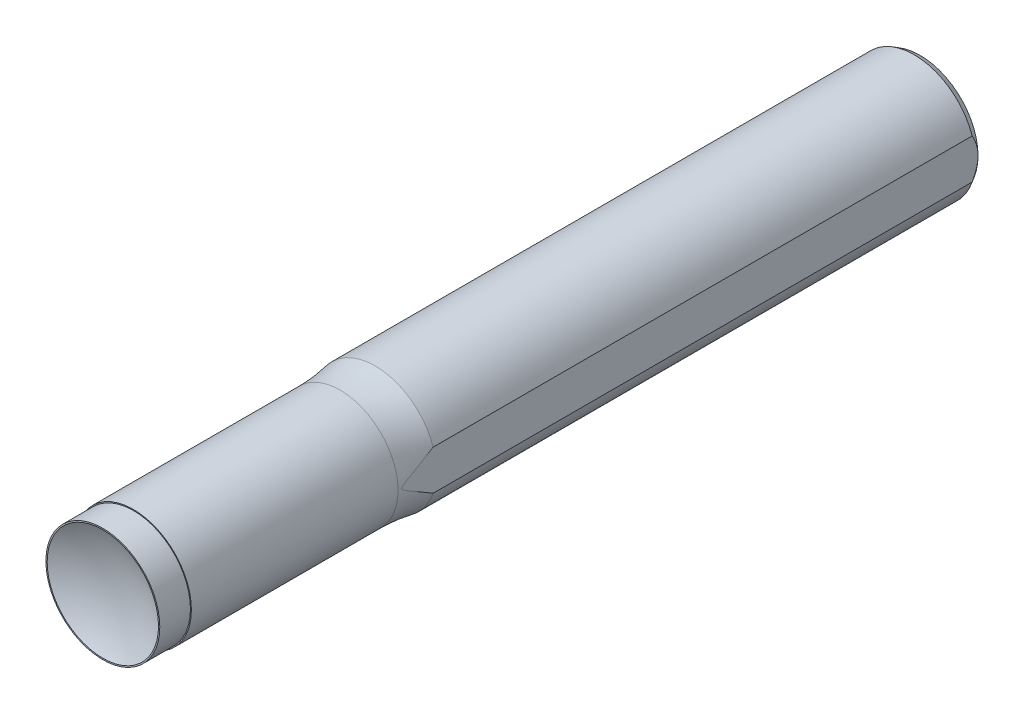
ISO-10303-21;
HEADER;
FILE_DESCRIPTION(('STEP AP214'),'2;1');
FILE_NAME('part.step','',(''),(''),'','','');
FILE_SCHEMA(('AUTOMOTIVE_DESIGN { 1 0 10303 214 1 1 1 1 }'));
ENDSEC;
DATA;
#1=APPLICATION_CONTEXT('core data for automotive mechanical design processes');
#2=APPLICATION_PROTOCOL_DEFINITION('international standard','automotive_design',2000,#1);
#3=PRODUCT_CONTEXT('',#1,'mechanical');
#4=PRODUCT('Part','Part','',(#3));
#5=PRODUCT_RELATED_PRODUCT_CATEGORY('part','',(#4));
#6=PRODUCT_DEFINITION_FORMATION('','',#4);
#7=PRODUCT_DEFINITION_CONTEXT('part definition',#1,'design');
#8=PRODUCT_DEFINITION('design','',#6,#7);
#9=PRODUCT_DEFINITION_SHAPE('','',#8);
#10=(LENGTH_UNIT() NAMED_UNIT(*) SI_UNIT(.MILLI.,.METRE.));
#11=(NAMED_UNIT(*) PLANE_ANGLE_UNIT() SI_UNIT($,.RADIAN.));
#12=(NAMED_UNIT(*) SI_UNIT($,.STERADIAN.) SOLID_ANGLE_UNIT());
#13=UNCERTAINTY_MEASURE_WITH_UNIT(LENGTH_MEASURE(1.E-05),#10,'distance_accuracy_value','');
#14=(GEOMETRIC_REPRESENTATION_CONTEXT(3) GLOBAL_UNCERTAINTY_ASSIGNED_CONTEXT((#13)) GLOBAL_UNIT_ASSIGNED_CONTEXT((#10,
#11,#12)) REPRESENTATION_CONTEXT('',''));
#15=CARTESIAN_POINT('',(0.,0.,0.));
#16=DIRECTION('',(0.,0.,1.));
#17=DIRECTION('',(1.,0.,0.));
#18=AXIS2_PLACEMENT_3D('',#15,#16,#17);
#19=CARTESIAN_POINT('',(0.,0.,-42.3333333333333));
#20=DIRECTION('',(0.,0.,1.));
#21=DIRECTION('',(1.,0.,0.));
#22=AXIS2_PLACEMENT_3D('',#19,#20,#21);
#23=CYLINDRICAL_SURFACE('',#22,9.);
#24=CARTESIAN_POINT('',(0.,0.,-36.8809829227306));
#25=DIRECTION('',(0.,0.,1.));
#26=DIRECTION('',(0.,-1.,0.));
#27=AXIS2_PLACEMENT_3D('',#24,#25,#26);
#28=CIRCLE('',#27,9.);
#29=CARTESIAN_POINT('',(0.,-9.,-36.8809829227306));
#30=VERTEX_POINT('',#29);
#31=EDGE_CURVE('E79',#30,#30,#28,.F.);
#32=ORIENTED_EDGE('',*,*,#31,.F.);
#33=EDGE_LOOP('',(#32));
#34=FACE_BOUND('',#33,.T.);
#35=CARTESIAN_POINT('',(0.,0.,-4.7625));
#36=DIRECTION('',(0.,0.,1.));
#37=DIRECTION('',(1.,0.,0.));
#38=AXIS2_PLACEMENT_3D('',#35,#36,#37);
#39=CIRCLE('',#38,9.);
#40=CARTESIAN_POINT('',(9.,0.,-4.7625));
#41=VERTEX_POINT('',#40);
#42=EDGE_CURVE('E90',#41,#41,#39,.F.);
#43=ORIENTED_EDGE('',*,*,#42,.T.);
#44=EDGE_LOOP('',(#43));
#45=FACE_BOUND('',#44,.T.);
#46=ADVANCED_FACE('F42',(#34,#45),#23,.T.);
#47=CARTESIAN_POINT('',(0.,0.,-4.7625));
#48=DIRECTION('',(0.,0.,1.));
#49=DIRECTION('',(1.,0.,0.));
#50=AXIS2_PLACEMENT_3D('',#47,#48,#49);
#51=PLANE('',#50);
#52=ORIENTED_EDGE('',*,*,#42,.F.);
#53=EDGE_LOOP('',(#52));
#54=FACE_BOUND('',#53,.T.);
#55=CARTESIAN_POINT('',(0.,0.,-4.7625));
#56=DIRECTION('',(0.,0.,1.));
#57=DIRECTION('',(1.,0.,0.));
#58=AXIS2_PLACEMENT_3D('',#55,#56,#57);
#59=CIRCLE('',#58,8.85);
#60=CARTESIAN_POINT('',(8.85,0.,-4.7625));
#61=VERTEX_POINT('',#60);
#62=EDGE_CURVE('E97',#61,#61,#59,.T.);
#63=ORIENTED_EDGE('',*,*,#62,.F.);
#64=EDGE_LOOP('',(#63));
#65=FACE_BOUND('',#64,.T.);
#66=ADVANCED_FACE('F110',(#54,#65),#51,.T.);
#67=CARTESIAN_POINT('',(0.,0.,-4.7625));
#68=DIRECTION('',(0.,0.,1.));
#69=DIRECTION('',(1.,0.,0.));
#70=AXIS2_PLACEMENT_3D('',#67,#68,#69);
#71=CYLINDRICAL_SURFACE('',#70,8.85);
#72=CARTESIAN_POINT('',(0.,0.,0.));
#73=DIRECTION('',(0.,0.,1.));
#74=DIRECTION('',(1.,0.,0.));
#75=AXIS2_PLACEMENT_3D('',#72,#73,#74);
#76=CIRCLE('',#75,8.85);
#77=CARTESIAN_POINT('',(8.85,0.,0.));
#78=VERTEX_POINT('',#77);
#79=EDGE_CURVE('E121',#78,#78,#76,.T.);
#80=CARTESIAN_POINT('',(8.85,0.,-4.7625));
#81=CARTESIAN_POINT('',(8.85,0.,-4.712890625));
#82=CARTESIAN_POINT('',(8.85,0.,-4.66328125));
#83=CARTESIAN_POINT('',(8.85,0.,-4.5640625));
#84=CARTESIAN_POINT('',(8.85,0.,-4.514453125));
#85=CARTESIAN_POINT('',(8.85,0.,-4.415234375));
#86=CARTESIAN_POINT('',(8.85,0.,-4.365625));
#87=CARTESIAN_POINT('',(8.85,0.,-4.26640625));
#88=CARTESIAN_POINT('',(8.85,0.,-4.216796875));
#89=CARTESIAN_POINT('',(8.85,0.,-4.117578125));
#90=CARTESIAN_POINT('',(8.85,0.,-4.06796875));
#91=CARTESIAN_POINT('',(8.85,0.,-3.96875));
#92=CARTESIAN_POINT('',(8.85,0.,-3.919140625));
#93=CARTESIAN_POINT('',(8.85,0.,-3.819921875));
#94=CARTESIAN_POINT('',(8.85,0.,-3.7703125));
#95=CARTESIAN_POINT('',(8.85,0.,-3.67109375));
#96=CARTESIAN_POINT('',(8.85,0.,-3.621484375));
#97=CARTESIAN_POINT('',(8.85,0.,-3.522265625));
#98=CARTESIAN_POINT('',(8.85,0.,-3.47265625));
#99=CARTESIAN_POINT('',(8.85,0.,-3.3734375));
#100=CARTESIAN_POINT('',(8.85,0.,-3.323828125));
#101=CARTESIAN_POINT('',(8.85,0.,-3.224609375));
#102=CARTESIAN_POINT('',(8.85,0.,-3.175));
#103=CARTESIAN_POINT('',(8.85,0.,-3.07578125));
#104=CARTESIAN_POINT('',(8.85,0.,-3.026171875));
#105=CARTESIAN_POINT('',(8.85,0.,-2.926953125));
#106=CARTESIAN_POINT('',(8.85,0.,-2.87734375));
#107=CARTESIAN_POINT('',(8.85,0.,-2.778125));
#108=CARTESIAN_POINT('',(8.85,0.,-2.728515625));
#109=CARTESIAN_POINT('',(8.85,0.,-2.629296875));
#110=CARTESIAN_POINT('',(8.85,0.,-2.5796875));
#111=CARTESIAN_POINT('',(8.85,0.,-2.48046875));
#112=CARTESIAN_POINT('',(8.85,0.,-2.430859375));
#113=CARTESIAN_POINT('',(8.85,0.,-2.331640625));
#114=CARTESIAN_POINT('',(8.85,0.,-2.28203125));
#115=CARTESIAN_POINT('',(8.85,0.,-2.1828125));
#116=CARTESIAN_POINT('',(8.85,0.,-2.133203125));
#117=CARTESIAN_POINT('',(8.85,0.,-2.033984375));
#118=CARTESIAN_POINT('',(8.85,0.,-1.984375));
#119=CARTESIAN_POINT('',(8.85,0.,-1.88515625));
#120=CARTESIAN_POINT('',(8.85,0.,-1.835546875));
#121=CARTESIAN_POINT('',(8.85,0.,-1.736328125));
#122=CARTESIAN_POINT('',(8.85,0.,-1.68671875));
#123=CARTESIAN_POINT('',(8.85,0.,-1.5875));
#124=CARTESIAN_POINT('',(8.85,0.,-1.537890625));
#125=CARTESIAN_POINT('',(8.85,0.,-1.438671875));
#126=CARTESIAN_POINT('',(8.85,0.,-1.3890625));
#127=CARTESIAN_POINT('',(8.85,0.,-1.28984375));
#128=CARTESIAN_POINT('',(8.85,0.,-1.240234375));
#129=CARTESIAN_POINT('',(8.85,0.,-1.141015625));
#130=CARTESIAN_POINT('',(8.85,0.,-1.09140625));
#131=CARTESIAN_POINT('',(8.85,0.,-0.9921875));
#132=CARTESIAN_POINT('',(8.85,0.,-0.942578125));
#133=CARTESIAN_POINT('',(8.85,0.,-0.843359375));
#134=CARTESIAN_POINT('',(8.85,0.,-0.79375));
#135=CARTESIAN_POINT('',(8.85,0.,-0.69453125));
#136=CARTESIAN_POINT('',(8.85,0.,-0.644921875));
#137=CARTESIAN_POINT('',(8.85,0.,-0.545703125));
#138=CARTESIAN_POINT('',(8.85,0.,-0.49609375));
#139=CARTESIAN_POINT('',(8.85,0.,-0.396875));
#140=CARTESIAN_POINT('',(8.85,0.,-0.347265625));
#141=CARTESIAN_POINT('',(8.85,0.,-0.248046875));
#142=CARTESIAN_POINT('',(8.85,0.,-0.1984375));
#143=CARTESIAN_POINT('',(8.85,0.,-0.09921875));
#144=CARTESIAN_POINT('',(8.85,0.,-0.049609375));
#145=CARTESIAN_POINT('',(8.85,0.,0.));
#146=B_SPLINE_CURVE_WITH_KNOTS('',3,(#80,#81,#82,#83,#84,#85,#86,#87,#88,#89,#90,#91,#92,#93,
#94,#95,#96,#97,#98,#99,#100,#101,#102,#103,#104,#105,#106,#107,#108,#109,#110,#111,#112,#113,
#114,#115,#116,#117,#118,#119,#120,#121,#122,#123,#124,#125,#126,#127,#128,#129,#130,#131,#132,
#133,#134,#135,#136,#137,#138,#139,#140,#141,#142,#143,#144,#145),.UNSPECIFIED.,.F.,.F.,(4,2,2,
2,2,2,2,2,2,2,2,2,2,2,2,2,2,2,2,2,2,2,2,2,2,2,2,2,2,2,2,2,4),(0.,0.148828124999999,
0.297656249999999,0.446484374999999,0.595312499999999,0.744140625,0.89296875,1.041796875,
1.190625,1.339453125,1.48828125,1.637109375,1.7859375,1.934765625,2.08359375,2.232421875,
2.38125,2.530078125,2.67890625,2.827734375,2.9765625,3.125390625,3.27421875,3.423046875,
3.571875,3.720703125,3.86953125,4.018359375,4.1671875,4.316015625,4.46484375,4.613671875,
4.7625),.UNSPECIFIED.);
#147=EDGE_CURVE('BSEAM116',#61,#78,#146,.T.);
#148=ORIENTED_EDGE('',*,*,#62,.T.);
#149=ORIENTED_EDGE('',*,*,#79,.F.);
#150=ORIENTED_EDGE('',*,*,#147,.T.);
#151=ORIENTED_EDGE('',*,*,#147,.F.);
#152=EDGE_LOOP('',(#148,#150,#149,#151));
#153=FACE_BOUND('',#152,.T.);
#154=ADVANCED_FACE('F116',(#153),#71,.T.);
#155=CARTESIAN_POINT('',(0.,0.,0.));
#156=DIRECTION('',(0.,0.,1.));
#157=DIRECTION('',(1.,0.,0.));
#158=AXIS2_PLACEMENT_3D('',#155,#156,#157);
#159=PLANE('',#158);
#160=CARTESIAN_POINT('',(0.,0.,0.));
#161=DIRECTION('',(0.,0.,1.));
#162=DIRECTION('',(0.,-1.,0.));
#163=AXIS2_PLACEMENT_3D('',#160,#161,#162);
#164=CIRCLE('',#163,8.65);
#165=CARTESIAN_POINT('',(0.,-8.65,0.));
#166=VERTEX_POINT('',#165);
#167=EDGE_CURVE('E125',#166,#166,#164,.T.);
#168=ORIENTED_EDGE('',*,*,#167,.F.);
#169=EDGE_LOOP('',(#168));
#170=FACE_BOUND('',#169,.T.);
#171=ORIENTED_EDGE('',*,*,#79,.T.);
#172=EDGE_LOOP('',(#171));
#173=FACE_BOUND('',#172,.T.);
#174=ADVANCED_FACE('F156',(#170,#173),#159,.T.);
#175=CARTESIAN_POINT('',(0.,0.,16.9729196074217));
#176=DIRECTION('',(0.,0.,1.));
#177=DIRECTION('',(0.,1.,0.));
#178=AXIS2_PLACEMENT_3D('',#175,#176,#177);
#179=SPHERICAL_SURFACE('',#178,19.05);
#180=ORIENTED_EDGE('',*,*,#167,.T.);
#181=EDGE_LOOP('',(#180));
#182=FACE_BOUND('',#181,.T.);
#183=ADVANCED_FACE('F159',(#182),#179,.F.);
#184=CARTESIAN_POINT('',(0.,0.,-36.8809829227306));
#185=DIRECTION('',(0.,0.,-1.));
#186=DIRECTION('',(0.,1.,0.));
#187=AXIS2_PLACEMENT_3D('',#184,#185,#186);
#188=TOROIDAL_SURFACE('',#187,37.575,28.575);
#189=CARTESIAN_POINT('',(9.00538475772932,8.67725819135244,-50.5944537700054));
#190=CARTESIAN_POINT('',(9.00538475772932,8.360516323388,-50.1927058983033));
#191=CARTESIAN_POINT('',(9.00538475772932,8.04942168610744,-49.786548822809));
#192=CARTESIAN_POINT('',(9.00538475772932,7.43781032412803,-48.9664415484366));
#193=CARTESIAN_POINT('',(9.00538475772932,7.1372919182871,-48.5524926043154));
#194=CARTESIAN_POINT('',(9.00538475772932,6.54634415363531,-47.7181615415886));
#195=CARTESIAN_POINT('',(9.00538475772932,6.25590396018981,-47.297787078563));
#196=CARTESIAN_POINT('',(9.00538475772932,5.68384783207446,-46.4510599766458));
#197=CARTESIAN_POINT('',(9.00538475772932,5.40223227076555,-46.0247070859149));
#198=CARTESIAN_POINT('',(9.00538475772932,4.84746770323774,-45.167919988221));
#199=CARTESIAN_POINT('',(9.00538475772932,4.57430082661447,-44.7374973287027));
#200=CARTESIAN_POINT('',(9.00538475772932,4.03465670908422,-43.87249524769));
#201=CARTESIAN_POINT('',(9.00538475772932,3.76817938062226,-43.4379158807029));
#202=CARTESIAN_POINT('',(9.00538475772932,3.24058462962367,-42.5654000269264));
#203=CARTESIAN_POINT('',(9.00538475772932,2.97946833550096,-42.1274628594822));
#204=CARTESIAN_POINT('',(9.00538475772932,2.4611922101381,-41.2492576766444));
#205=CARTESIAN_POINT('',(9.00538475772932,2.20403239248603,-40.8089896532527));
#206=CARTESIAN_POINT('',(9.00538475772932,1.78617791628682,-40.0907109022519));
#207=CARTESIAN_POINT('',(9.00538475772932,1.62501467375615,-39.8129696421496));
#208=CARTESIAN_POINT('',(9.00538475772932,1.30228318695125,-39.2577811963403));
#209=CARTESIAN_POINT('',(9.00538475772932,1.14071502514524,-38.980333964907));
#210=CARTESIAN_POINT('',(9.00538475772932,0.908170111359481,-38.5881784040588));
#211=CARTESIAN_POINT('',(9.00538475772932,0.838993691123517,-38.4724013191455));
#212=CARTESIAN_POINT('',(9.00538475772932,0.698861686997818,-38.2418326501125));
#213=CARTESIAN_POINT('',(9.00538475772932,0.627905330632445,-38.1270415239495));
#214=CARTESIAN_POINT('',(9.00538475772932,0.499784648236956,-37.9283676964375));
#215=CARTESIAN_POINT('',(9.00538475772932,0.443562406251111,-37.8438778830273));
#216=CARTESIAN_POINT('',(9.00538475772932,0.345175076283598,-37.7077323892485));
#217=CARTESIAN_POINT('',(9.00538475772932,0.304872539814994,-37.6548263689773));
#218=CARTESIAN_POINT('',(9.00538475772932,0.239031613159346,-37.5795982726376));
#219=CARTESIAN_POINT('',(9.00538475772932,0.216027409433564,-37.5550721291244));
#220=CARTESIAN_POINT('',(9.00538475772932,0.166959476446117,-37.5092418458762));
#221=CARTESIAN_POINT('',(9.00538475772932,0.140918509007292,-37.4879161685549));
#222=CARTESIAN_POINT('',(9.00538475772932,0.101310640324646,-37.4640316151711));
#223=CARTESIAN_POINT('',(9.00538475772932,0.0899162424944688,-37.4579950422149));
#224=CARTESIAN_POINT('',(9.00538475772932,0.0663316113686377,-37.4477755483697));
#225=CARTESIAN_POINT('',(9.00538475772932,0.0541440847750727,-37.4435866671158));
#226=CARTESIAN_POINT('',(9.00538475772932,0.0317764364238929,-37.4383069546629));
#227=CARTESIAN_POINT('',(9.00538475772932,0.0217083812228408,-37.4367519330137));
#228=CARTESIAN_POINT('',(9.00538475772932,0.00145076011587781,-37.435412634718));
#229=CARTESIAN_POINT('',(9.00538475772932,-0.00873878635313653,-37.435628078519));
#230=CARTESIAN_POINT('',(9.00538475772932,-0.0288947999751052,-37.4377930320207));
#231=CARTESIAN_POINT('',(9.00538475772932,-0.0388618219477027,-37.439737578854));
#232=CARTESIAN_POINT('',(9.00538475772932,-0.0583851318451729,-37.4451003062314));
#233=CARTESIAN_POINT('',(9.00538475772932,-0.0679410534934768,-37.448519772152));
#234=CARTESIAN_POINT('',(9.00538475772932,-0.0935600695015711,-37.4594972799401));
#235=CARTESIAN_POINT('',(9.00538475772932,-0.109109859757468,-37.4682334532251));
#236=CARTESIAN_POINT('',(9.00538475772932,-0.138829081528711,-37.487823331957));
#237=CARTESIAN_POINT('',(9.00538475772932,-0.152991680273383,-37.4986867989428));
#238=CARTESIAN_POINT('',(9.00538475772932,-0.215025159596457,-37.5505926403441));
#239=CARTESIAN_POINT('',(9.00538475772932,-0.257135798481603,-37.5981975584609));
#240=CARTESIAN_POINT('',(9.00538475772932,-0.336996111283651,-37.6968422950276));
#241=CARTESIAN_POINT('',(9.00538475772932,-0.374711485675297,-37.747904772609));
#242=CARTESIAN_POINT('',(9.00538475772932,-0.483449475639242,-37.9018139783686));
#243=CARTESIAN_POINT('',(9.00538475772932,-0.551372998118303,-38.0069407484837));
#244=CARTESIAN_POINT('',(9.00538475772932,-0.684657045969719,-38.2188045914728));
#245=CARTESIAN_POINT('',(9.00538475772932,-0.750014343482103,-38.3255434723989));
#246=CARTESIAN_POINT('',(9.00538475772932,-0.879095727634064,-38.5393412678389));
#247=CARTESIAN_POINT('',(9.00538475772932,-0.942826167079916,-38.6463961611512));
#248=CARTESIAN_POINT('',(9.00538475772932,-1.06961925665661,-38.8608148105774));
#249=CARTESIAN_POINT('',(9.00538475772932,-1.13268222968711,-38.9681783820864));
#250=CARTESIAN_POINT('',(9.00538475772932,-1.32132247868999,-39.2904392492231));
#251=CARTESIAN_POINT('',(9.00538475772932,-1.44641873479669,-39.505620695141));
#252=CARTESIAN_POINT('',(9.00538475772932,-1.69647961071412,-39.9360597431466));
#253=CARTESIAN_POINT('',(9.00538475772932,-1.82144422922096,-40.1513173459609));
#254=CARTESIAN_POINT('',(9.00538475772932,-2.1969483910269,-40.7968422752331));
#255=CARTESIAN_POINT('',(9.00538475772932,-2.44805295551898,-41.2267832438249));
#256=CARTESIAN_POINT('',(9.00538475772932,-2.9543689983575,-42.0851322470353));
#257=CARTESIAN_POINT('',(9.00538475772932,-3.20958616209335,-42.5135369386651));
#258=CARTESIAN_POINT('',(9.00538475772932,-3.72513842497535,-43.3672539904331));
#259=CARTESIAN_POINT('',(9.00538475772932,-3.98547346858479,-43.7925663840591));
#260=CARTESIAN_POINT('',(9.00538475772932,-4.59115410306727,-44.7656913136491));
#261=CARTESIAN_POINT('',(9.00538475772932,-4.93867072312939,-45.3121585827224));
#262=CARTESIAN_POINT('',(9.00538475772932,-5.64660812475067,-46.3966394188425));
#263=CARTESIAN_POINT('',(9.00538475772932,-6.00702804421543,-46.9346535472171));
#264=CARTESIAN_POINT('',(9.00538475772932,-6.74258485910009,-48.0001402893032));
#265=CARTESIAN_POINT('',(9.00538475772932,-7.11771373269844,-48.527618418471));
#266=CARTESIAN_POINT('',(9.00538475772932,-7.88461680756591,-49.570568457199));
#267=CARTESIAN_POINT('',(9.00538475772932,-8.27639614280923,-50.0860365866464));
#268=CARTESIAN_POINT('',(9.00538475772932,-8.67725819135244,-50.5944537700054));
#269=B_SPLINE_CURVE_WITH_KNOTS('',3,(#189,#190,#191,#192,#193,#194,#195,#196,#197,#198,#199,
#200,#201,#202,#203,#204,#205,#206,#207,#208,#209,#210,#211,#212,#213,#214,#215,#216,#217,#218,
#219,#220,#221,#222,#223,#224,#225,#226,#227,#228,#229,#230,#231,#232,#233,#234,#235,#236,#237,
#238,#239,#240,#241,#242,#243,#244,#245,#246,#247,#248,#249,#250,#251,#252,#253,#254,#255,#256,
#257,#258,#259,#260,#261,#262,#263,#264,#265,#266,#267,#268),.UNSPECIFIED.,.F.,.F.,(4,2,2,2,2,2,
2,2,2,2,2,2,2,2,2,2,2,2,2,2,2,2,2,2,2,2,2,2,2,2,2,2,2,2,2,2,2,2,2,4),(0.,1.53467788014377,
3.06911070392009,4.60183932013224,6.13463269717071,7.66392477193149,9.19319682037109,
10.7227875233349,12.2523834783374,13.2157300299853,14.1788941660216,14.5835044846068,
14.9882935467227,15.2927250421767,15.4918768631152,15.5927080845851,15.6928269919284,
15.7313998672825,15.7698473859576,15.800268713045,15.830685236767,15.8610147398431,
15.8913707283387,15.9445651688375,15.9980096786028,16.1872142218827,16.3778083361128,
16.75289895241,17.1284471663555,17.5021855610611,17.8757340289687,18.622433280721,
19.3691398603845,20.8628248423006,22.3587905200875,23.8547399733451,25.7974040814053,
27.739938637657,29.681428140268,31.6235206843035),.UNSPECIFIED.);
#270=CARTESIAN_POINT('',(9.00538475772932,3.10300988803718,-42.3333333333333));
#271=VERTEX_POINT('',#270);
#272=CARTESIAN_POINT('',(9.00538475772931,-3.10300988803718,-42.3333333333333));
#273=VERTEX_POINT('',#272);
#274=EDGE_CURVE('E58',#271,#273,#269,.T.);
#275=ORIENTED_EDGE('',*,*,#274,.F.);
#276=CARTESIAN_POINT('',(0.,0.,-42.3333333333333));
#277=DIRECTION('',(0.,0.,-1.));
#278=DIRECTION('',(0.,1.,0.));
#279=AXIS2_PLACEMENT_3D('',#276,#277,#278);
#280=CIRCLE('',#279,9.525);
#281=EDGE_CURVE('E129',#273,#271,#280,.T.);
#282=ORIENTED_EDGE('',*,*,#281,.F.);
#283=EDGE_LOOP('',(#275,#282));
#284=FACE_BOUND('',#283,.T.);
#285=ORIENTED_EDGE('',*,*,#31,.T.);
#286=EDGE_LOOP('',(#285));
#287=FACE_BOUND('',#286,.T.);
#288=ADVANCED_FACE('F106',(#284,#287),#188,.F.);
#289=CARTESIAN_POINT('',(0.,0.,-127.));
#290=DIRECTION('',(0.,0.,1.));
#291=DIRECTION('',(1.,0.,0.));
#292=AXIS2_PLACEMENT_3D('',#289,#290,#291);
#293=PLANE('',#292);
#294=CARTESIAN_POINT('',(0.,0.,-127.));
#295=DIRECTION('',(0.,0.,1.));
#296=DIRECTION('',(1.,0.,0.));
#297=AXIS2_PLACEMENT_3D('',#294,#295,#296);
#298=CIRCLE('',#297,9.00538475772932);
#299=CARTESIAN_POINT('',(9.00538475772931,0.,-127.));
#300=VERTEX_POINT('',#299);
#301=EDGE_CURVE('E85',#300,#300,#298,.F.);
#302=ORIENTED_EDGE('',*,*,#301,.T.);
#303=EDGE_LOOP('',(#302));
#304=FACE_BOUND('',#303,.T.);
#305=ADVANCED_FACE('F154',(#304),#293,.F.);
#306=CARTESIAN_POINT('',(0.,0.,-126.1));
#307=DIRECTION('',(0.,0.,1.));
#308=DIRECTION('',(1.,0.,0.));
#309=AXIS2_PLACEMENT_3D('',#306,#307,#308);
#310=CONICAL_SURFACE('',#309,9.525,0.523598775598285);
#311=CARTESIAN_POINT('',(9.00538475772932,-9.37414932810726,-120.083013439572));
#312=CARTESIAN_POINT('',(9.00538475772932,-9.16175932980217,-120.34822576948));
#313=CARTESIAN_POINT('',(9.00538475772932,-8.94731647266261,-120.611824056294));
#314=CARTESIAN_POINT('',(9.00538475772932,-8.51338711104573,-121.135015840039));
#315=CARTESIAN_POINT('',(9.00538475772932,-8.29389854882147,-121.394607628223));
#316=CARTESIAN_POINT('',(9.00538475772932,-7.84482720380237,-121.913744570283));
#317=CARTESIAN_POINT('',(9.00538475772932,-7.61513139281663,-122.173192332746));
#318=CARTESIAN_POINT('',(9.00538475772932,-7.14856882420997,-122.685494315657));
#319=CARTESIAN_POINT('',(9.00538475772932,-6.91170335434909,-122.93834970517));
#320=CARTESIAN_POINT('',(9.00538475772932,-6.39819323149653,-123.467766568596));
#321=CARTESIAN_POINT('',(9.00538475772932,-6.12035759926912,-123.743180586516));
#322=CARTESIAN_POINT('',(9.00538475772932,-5.55073178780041,-124.279730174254));
#323=CARTESIAN_POINT('',(9.00538475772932,-5.25893244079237,-124.540856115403));
#324=CARTESIAN_POINT('',(9.00538475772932,-4.66074771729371,-125.040618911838));
#325=CARTESIAN_POINT('',(9.00538475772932,-4.35450812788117,-125.279428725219));
#326=CARTESIAN_POINT('',(9.00538475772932,-3.72156242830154,-125.727951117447));
#327=CARTESIAN_POINT('',(9.00538475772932,-3.39489317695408,-125.937714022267));
#328=CARTESIAN_POINT('',(9.00538475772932,-2.9600610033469,-126.179746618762));
#329=CARTESIAN_POINT('',(9.00538475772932,-2.86274197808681,-126.231651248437));
#330=CARTESIAN_POINT('',(9.00538475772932,-2.66613516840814,-126.331587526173));
#331=CARTESIAN_POINT('',(9.00538475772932,-2.56684736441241,-126.379619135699));
#332=CARTESIAN_POINT('',(9.00538475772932,-2.26590999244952,-126.517310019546));
#333=CARTESIAN_POINT('',(9.00538475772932,-2.06123808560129,-126.600536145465));
#334=CARTESIAN_POINT('',(9.00538475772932,-1.64856902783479,-126.744577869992));
#335=CARTESIAN_POINT('',(9.00538475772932,-1.44071509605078,-126.805799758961));
#336=CARTESIAN_POINT('',(9.00538475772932,-1.01944204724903,-126.904524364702));
#337=CARTESIAN_POINT('',(9.00538475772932,-0.806026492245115,-126.942041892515));
#338=CARTESIAN_POINT('',(9.00538475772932,-0.434973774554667,-126.984155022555));
#339=CARTESIAN_POINT('',(9.00538475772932,-0.278021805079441,-126.994943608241));
#340=CARTESIAN_POINT('',(9.00538475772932,0.0361988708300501,-127.002244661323));
#341=CARTESIAN_POINT('',(9.00538475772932,0.193467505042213,-126.998760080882));
#342=CARTESIAN_POINT('',(9.00538475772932,0.507532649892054,-126.977620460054));
#343=CARTESIAN_POINT('',(9.00538475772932,0.664326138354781,-126.9599210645));
#344=CARTESIAN_POINT('',(9.00538475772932,0.975790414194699,-126.9110015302));
#345=CARTESIAN_POINT('',(9.00538475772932,1.13046079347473,-126.879778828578));
#346=CARTESIAN_POINT('',(9.00538475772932,1.47736512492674,-126.794988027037));
#347=CARTESIAN_POINT('',(9.00538475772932,1.66868786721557,-126.737690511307));
#348=CARTESIAN_POINT('',(9.00538475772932,2.04535465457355,-126.60594193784));
#349=CARTESIAN_POINT('',(9.00538475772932,2.23069522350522,-126.531481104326));
#350=CARTESIAN_POINT('',(9.00538475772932,2.59535761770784,-126.368021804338));
#351=CARTESIAN_POINT('',(9.00538475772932,2.77466282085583,-126.278986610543));
#352=CARTESIAN_POINT('',(9.00538475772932,3.12679908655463,-126.089074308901));
#353=CARTESIAN_POINT('',(9.00538475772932,3.29963086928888,-125.98819852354));
#354=CARTESIAN_POINT('',(9.00538475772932,3.68659694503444,-125.747248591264));
#355=CARTESIAN_POINT('',(9.00538475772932,3.89880296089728,-125.604089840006));
#356=CARTESIAN_POINT('',(9.00538475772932,4.31439017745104,-125.305430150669));
#357=CARTESIAN_POINT('',(9.00538475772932,4.51776736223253,-125.149923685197));
#358=CARTESIAN_POINT('',(9.00538475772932,4.91709892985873,-124.828978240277));
#359=CARTESIAN_POINT('',(9.00538475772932,5.11303894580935,-124.663521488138));
#360=CARTESIAN_POINT('',(9.00538475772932,5.49810941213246,-124.324963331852));
#361=CARTESIAN_POINT('',(9.00538475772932,5.68724090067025,-124.151863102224));
#362=CARTESIAN_POINT('',(9.00538475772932,6.06051337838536,-123.798669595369));
#363=CARTESIAN_POINT('',(9.00538475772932,6.24462692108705,-123.618547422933));
#364=CARTESIAN_POINT('',(9.00538475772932,6.6077394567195,-123.253223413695));
#365=CARTESIAN_POINT('',(9.00538475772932,6.78673827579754,-123.068021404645));
#366=CARTESIAN_POINT('',(9.00538475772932,7.14011351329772,-122.693613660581));
#367=CARTESIAN_POINT('',(9.00538475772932,7.31449430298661,-122.504412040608));
#368=CARTESIAN_POINT('',(9.00538475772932,7.65938614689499,-122.12251348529));
#369=CARTESIAN_POINT('',(9.00538475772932,7.8298971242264,-121.929816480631));
#370=CARTESIAN_POINT('',(9.00538475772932,8.11671157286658,-121.599913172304));
#371=CARTESIAN_POINT('',(9.00538475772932,8.23388459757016,-121.463460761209));
#372=CARTESIAN_POINT('',(9.00538475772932,8.46671931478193,-121.189258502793));
#373=CARTESIAN_POINT('',(9.00538475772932,8.58238090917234,-121.051508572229));
#374=CARTESIAN_POINT('',(9.00538475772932,8.92554228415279,-120.638588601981));
#375=CARTESIAN_POINT('',(9.00538475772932,9.15098666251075,-120.361706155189));
#376=CARTESIAN_POINT('',(9.00538475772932,9.37414932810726,-120.083013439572));
#377=B_SPLINE_CURVE_WITH_KNOTS('',3,(#311,#312,#313,#314,#315,#316,#317,#318,#319,#320,#321,
#322,#323,#324,#325,#326,#327,#328,#329,#330,#331,#332,#333,#334,#335,#336,#337,#338,#339,#340,
#341,#342,#343,#344,#345,#346,#347,#348,#349,#350,#351,#352,#353,#354,#355,#356,#357,#358,#359,
#360,#361,#362,#363,#364,#365,#366,#367,#368,#369,#370,#371,#372,#373,#374,#375,#376),
.UNSPECIFIED.,.F.,.F.,(4,2,2,2,2,2,2,2,2,2,2,2,2,2,2,2,2,2,2,2,2,2,2,2,2,2,2,2,2,2,2,2,4),(0.,
1.01934972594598,2.03912281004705,3.07855684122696,4.11780527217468,5.29106103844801,
6.4650979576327,7.62911214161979,8.79108365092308,9.12189780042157,9.45271524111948,
10.1145275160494,10.763402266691,11.4118711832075,11.8832328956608,12.354497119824,
12.8272375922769,13.3000676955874,13.8982385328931,14.496750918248,15.0967954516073,
15.696773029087,16.4641256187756,17.2318236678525,18.0009361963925,18.769930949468,
19.5425187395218,20.315132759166,21.0869872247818,21.8588570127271,22.3984188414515,
22.9380155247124,24.0091067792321),.UNSPECIFIED.);
#378=CARTESIAN_POINT('',(9.00538475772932,-3.10300988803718,-126.1));
#379=VERTEX_POINT('',#378);
#380=EDGE_CURVE('E73',#379,#300,#377,.T.);
#381=ORIENTED_EDGE('',*,*,#380,.F.);
#382=CARTESIAN_POINT('',(0.,0.,-126.1));
#383=DIRECTION('',(0.,0.,1.));
#384=DIRECTION('',(1.,0.,0.));
#385=AXIS2_PLACEMENT_3D('',#382,#383,#384);
#386=CIRCLE('',#385,9.525);
#387=CARTESIAN_POINT('',(9.00538475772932,3.10300988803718,-126.1));
#388=VERTEX_POINT('',#387);
#389=EDGE_CURVE('E83',#388,#379,#386,.T.);
#390=ORIENTED_EDGE('',*,*,#389,.F.);
#391=EDGE_CURVE('E64',#300,#388,#377,.T.);
#392=ORIENTED_EDGE('',*,*,#391,.F.);
#393=ORIENTED_EDGE('',*,*,#301,.F.);
#394=EDGE_LOOP('',(#381,#390,#392,#393));
#395=FACE_BOUND('',#394,.T.);
#396=ADVANCED_FACE('F44',(#395),#310,.T.);
#397=CARTESIAN_POINT('',(0.,0.,-127.));
#398=DIRECTION('',(0.,0.,1.));
#399=DIRECTION('',(1.,0.,0.));
#400=AXIS2_PLACEMENT_3D('',#397,#398,#399);
#401=CYLINDRICAL_SURFACE('',#400,9.525);
#402=DIRECTION('',(0.,0.,1.));
#403=VECTOR('',#402,1.);
#404=CARTESIAN_POINT('',(9.00538475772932,3.10300988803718,-127.));
#405=LINE('',#404,#403);
#406=EDGE_CURVE('E13',#388,#271,#405,.T.);
#407=ORIENTED_EDGE('',*,*,#406,.F.);
#408=ORIENTED_EDGE('',*,*,#389,.T.);
#409=DIRECTION('',(0.,0.,1.));
#410=VECTOR('',#409,1.);
#411=CARTESIAN_POINT('',(9.00538475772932,-3.10300988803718,-127.));
#412=LINE('',#411,#410);
#413=EDGE_CURVE('E52',#273,#379,#412,.F.);
#414=ORIENTED_EDGE('',*,*,#413,.F.);
#415=ORIENTED_EDGE('',*,*,#281,.T.);
#416=EDGE_LOOP('',(#407,#408,#414,#415));
#417=FACE_BOUND('',#416,.T.);
#418=ADVANCED_FACE('F88',(#417),#401,.T.);
#419=CARTESIAN_POINT('',(9.00538475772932,3.10300988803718,0.));
#420=DIRECTION('',(-1.,0.,0.));
#421=DIRECTION('',(0.,0.,1.));
#422=AXIS2_PLACEMENT_3D('',#419,#420,#421);
#423=PLANE('',#422);
#424=ORIENTED_EDGE('',*,*,#274,.T.);
#425=ORIENTED_EDGE('',*,*,#413,.T.);
#426=ORIENTED_EDGE('',*,*,#380,.T.);
#427=ORIENTED_EDGE('',*,*,#391,.T.);
#428=ORIENTED_EDGE('',*,*,#406,.T.);
#429=EDGE_LOOP('',(#424,#425,#426,#427,#428));
#430=FACE_BOUND('',#429,.T.);
#431=ADVANCED_FACE('F72',(#430),#423,.F.);
#432=CLOSED_SHELL('',(#46,#66,#154,#174,#183,#288,#305,#396,#418,#431));
#433=MANIFOLD_SOLID_BREP('B2',#432);
#434=ADVANCED_BREP_SHAPE_REPRESENTATION('',(#18,#433),#14);
#435=SHAPE_DEFINITION_REPRESENTATION(#9,#434);
ENDSEC;
END-ISO-10303-21;
